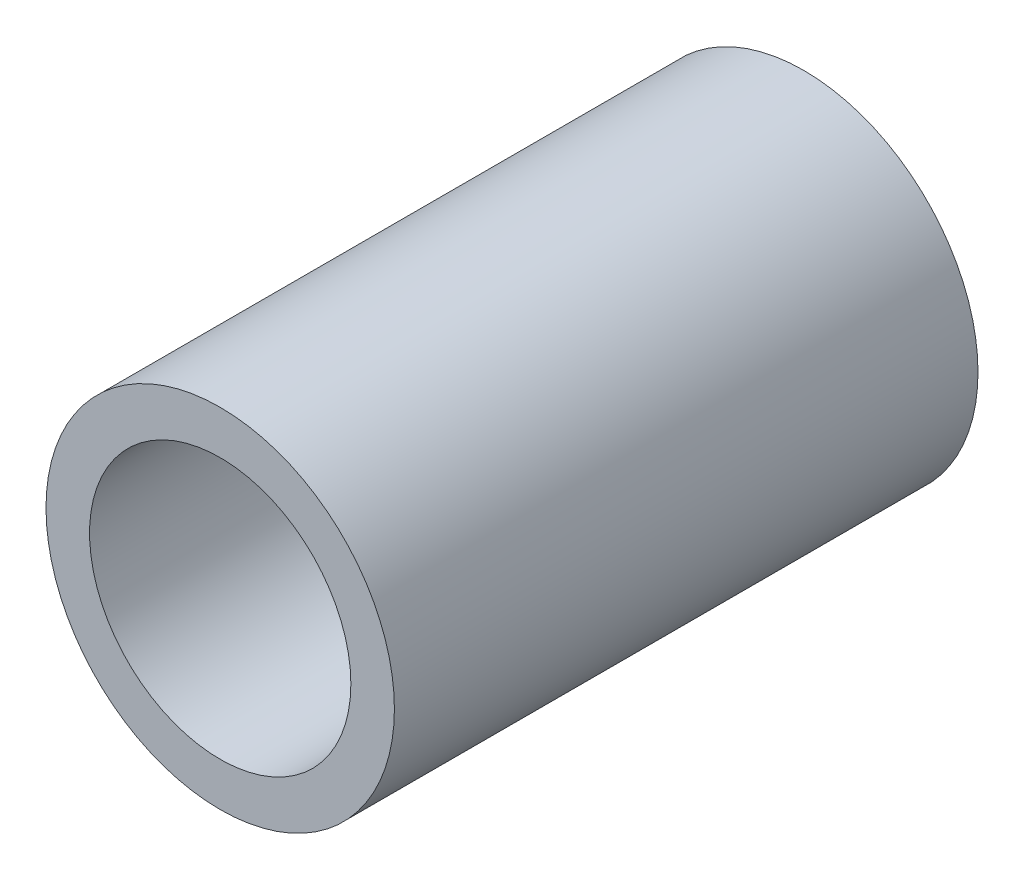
ISO-10303-21;
HEADER;
FILE_DESCRIPTION(('STEP AP214'),'2;1');
FILE_NAME('part.step','',(''),(''),'','','');
FILE_SCHEMA(('AUTOMOTIVE_DESIGN { 1 0 10303 214 1 1 1 1 }'));
ENDSEC;
DATA;
#1=APPLICATION_CONTEXT('core data for automotive mechanical design processes');
#2=APPLICATION_PROTOCOL_DEFINITION('international standard','automotive_design',2000,#1);
#3=PRODUCT_CONTEXT('',#1,'mechanical');
#4=PRODUCT('Part','Part','',(#3));
#5=PRODUCT_RELATED_PRODUCT_CATEGORY('part','',(#4));
#6=PRODUCT_DEFINITION_FORMATION('','',#4);
#7=PRODUCT_DEFINITION_CONTEXT('part definition',#1,'design');
#8=PRODUCT_DEFINITION('design','',#6,#7);
#9=PRODUCT_DEFINITION_SHAPE('','',#8);
#10=(LENGTH_UNIT() NAMED_UNIT(*) SI_UNIT(.MILLI.,.METRE.));
#11=(NAMED_UNIT(*) PLANE_ANGLE_UNIT() SI_UNIT($,.RADIAN.));
#12=(NAMED_UNIT(*) SI_UNIT($,.STERADIAN.) SOLID_ANGLE_UNIT());
#13=UNCERTAINTY_MEASURE_WITH_UNIT(LENGTH_MEASURE(1.E-05),#10,'distance_accuracy_value','');
#14=(GEOMETRIC_REPRESENTATION_CONTEXT(3) GLOBAL_UNCERTAINTY_ASSIGNED_CONTEXT((#13)) GLOBAL_UNIT_ASSIGNED_CONTEXT((#10,
#11,#12)) REPRESENTATION_CONTEXT('',''));
#15=CARTESIAN_POINT('',(0.,0.,0.));
#16=DIRECTION('',(0.,0.,1.));
#17=DIRECTION('',(1.,0.,0.));
#18=AXIS2_PLACEMENT_3D('',#15,#16,#17);
#19=CARTESIAN_POINT('',(0.,2.22044604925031E-12,67.));
#20=DIRECTION('',(0.,0.,1.));
#21=DIRECTION('',(1.,0.,0.));
#22=AXIS2_PLACEMENT_3D('',#19,#20,#21);
#23=PLANE('',#22);
#24=CARTESIAN_POINT('',(0.,2.22044604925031E-12,67.));
#25=DIRECTION('',(0.,0.,1.));
#26=DIRECTION('',(1.,0.,0.));
#27=AXIS2_PLACEMENT_3D('',#24,#25,#26);
#28=CIRCLE('',#27,20.);
#29=CARTESIAN_POINT('',(20.,2.2216955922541E-12,67.));
#30=VERTEX_POINT('',#29);
#31=EDGE_CURVE('E10',#30,#30,#28,.T.);
#32=ORIENTED_EDGE('',*,*,#31,.T.);
#33=EDGE_LOOP('',(#32));
#34=FACE_BOUND('',#33,.T.);
#35=CARTESIAN_POINT('',(0.,2.22044604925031E-12,67.));
#36=DIRECTION('',(0.,0.,1.));
#37=DIRECTION('',(1.,0.,0.));
#38=AXIS2_PLACEMENT_3D('',#35,#36,#37);
#39=CIRCLE('',#38,15.);
#40=CARTESIAN_POINT('',(15.,2.22138320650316E-12,67.));
#41=VERTEX_POINT('',#40);
#42=EDGE_CURVE('E44',#41,#41,#39,.T.);
#43=ORIENTED_EDGE('',*,*,#42,.F.);
#44=EDGE_LOOP('',(#43));
#45=FACE_BOUND('',#44,.T.);
#46=ADVANCED_FACE('F33',(#34,#45),#23,.T.);
#47=CARTESIAN_POINT('',(0.,0.,0.));
#48=DIRECTION('',(0.,0.,1.));
#49=DIRECTION('',(1.,0.,0.));
#50=AXIS2_PLACEMENT_3D('',#47,#48,#49);
#51=PLANE('',#50);
#52=CARTESIAN_POINT('',(0.,0.,0.));
#53=DIRECTION('',(0.,0.,1.));
#54=DIRECTION('',(1.,0.,0.));
#55=AXIS2_PLACEMENT_3D('',#52,#53,#54);
#56=CIRCLE('',#55,20.);
#57=CARTESIAN_POINT('',(20.,0.,0.));
#58=VERTEX_POINT('',#57);
#59=EDGE_CURVE('E40',#58,#58,#56,.T.);
#60=ORIENTED_EDGE('',*,*,#59,.F.);
#61=EDGE_LOOP('',(#60));
#62=FACE_BOUND('',#61,.T.);
#63=CARTESIAN_POINT('',(0.,0.,0.));
#64=DIRECTION('',(0.,0.,1.));
#65=DIRECTION('',(1.,0.,0.));
#66=AXIS2_PLACEMENT_3D('',#63,#64,#65);
#67=CIRCLE('',#66,15.);
#68=CARTESIAN_POINT('',(15.,0.,0.));
#69=VERTEX_POINT('',#68);
#70=EDGE_CURVE('E48',#69,#69,#67,.T.);
#71=ORIENTED_EDGE('',*,*,#70,.T.);
#72=EDGE_LOOP('',(#71));
#73=FACE_BOUND('',#72,.T.);
#74=ADVANCED_FACE('F54',(#62,#73),#51,.F.);
#75=CARTESIAN_POINT('',(0.,2.22044604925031E-12,67.));
#76=DIRECTION('',(0.,0.,-1.));
#77=DIRECTION('',(-1.,0.,0.));
#78=AXIS2_PLACEMENT_3D('',#75,#76,#77);
#79=CYLINDRICAL_SURFACE('',#78,20.);
#80=ORIENTED_EDGE('',*,*,#31,.F.);
#81=EDGE_LOOP('',(#80));
#82=FACE_BOUND('',#81,.T.);
#83=ORIENTED_EDGE('',*,*,#59,.T.);
#84=EDGE_LOOP('',(#83));
#85=FACE_BOUND('',#84,.T.);
#86=ADVANCED_FACE('F35',(#82,#85),#79,.T.);
#87=CARTESIAN_POINT('',(0.,2.22044604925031E-12,67.));
#88=DIRECTION('',(0.,0.,-1.));
#89=DIRECTION('',(-1.,0.,0.));
#90=AXIS2_PLACEMENT_3D('',#87,#88,#89);
#91=CYLINDRICAL_SURFACE('',#90,15.);
#92=ORIENTED_EDGE('',*,*,#42,.T.);
#93=EDGE_LOOP('',(#92));
#94=FACE_BOUND('',#93,.T.);
#95=ORIENTED_EDGE('',*,*,#70,.F.);
#96=EDGE_LOOP('',(#95));
#97=FACE_BOUND('',#96,.T.);
#98=ADVANCED_FACE('F56',(#94,#97),#91,.F.);
#99=CLOSED_SHELL('',(#46,#74,#86,#98));
#100=MANIFOLD_SOLID_BREP('B2',#99);
#101=ADVANCED_BREP_SHAPE_REPRESENTATION('',(#18,#100),#14);
#102=SHAPE_DEFINITION_REPRESENTATION(#9,#101);
ENDSEC;
END-ISO-10303-21;
